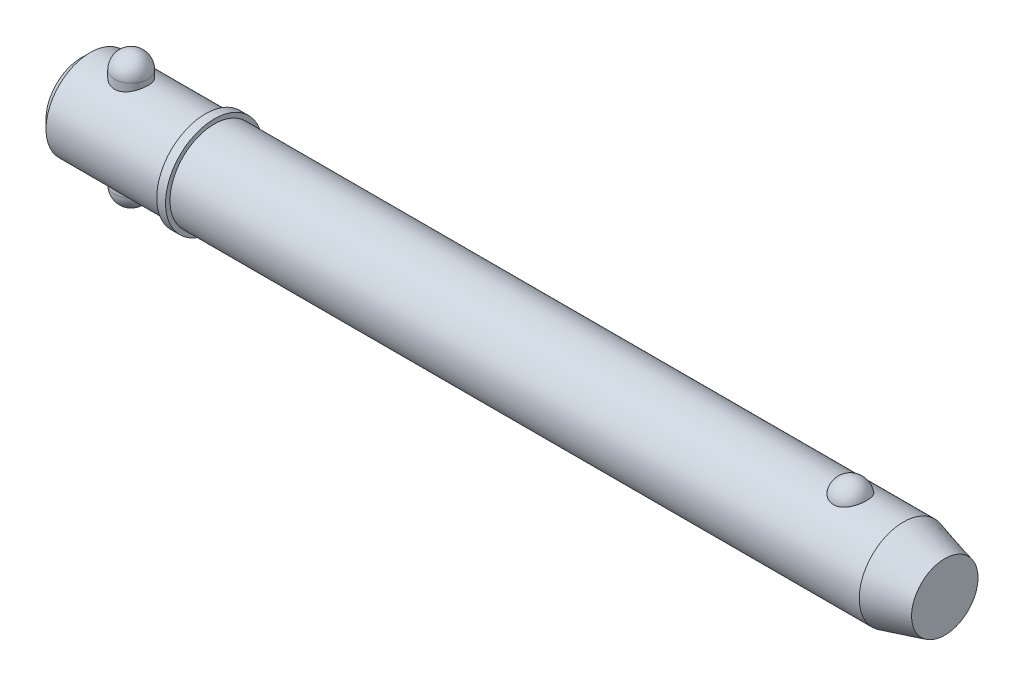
ISO-10303-21;
HEADER;
FILE_DESCRIPTION(('STEP AP214'),'2;1');
FILE_NAME('part.step','',(''),(''),'','','');
FILE_SCHEMA(('AUTOMOTIVE_DESIGN { 1 0 10303 214 1 1 1 1 }'));
ENDSEC;
DATA;
#1=APPLICATION_CONTEXT('core data for automotive mechanical design processes');
#2=APPLICATION_PROTOCOL_DEFINITION('international standard','automotive_design',2000,#1);
#3=PRODUCT_CONTEXT('',#1,'mechanical');
#4=PRODUCT('Part','Part','',(#3));
#5=PRODUCT_RELATED_PRODUCT_CATEGORY('part','',(#4));
#6=PRODUCT_DEFINITION_FORMATION('','',#4);
#7=PRODUCT_DEFINITION_CONTEXT('part definition',#1,'design');
#8=PRODUCT_DEFINITION('design','',#6,#7);
#9=PRODUCT_DEFINITION_SHAPE('','',#8);
#10=(LENGTH_UNIT() NAMED_UNIT(*) SI_UNIT(.MILLI.,.METRE.));
#11=(NAMED_UNIT(*) PLANE_ANGLE_UNIT() SI_UNIT($,.RADIAN.));
#12=(NAMED_UNIT(*) SI_UNIT($,.STERADIAN.) SOLID_ANGLE_UNIT());
#13=UNCERTAINTY_MEASURE_WITH_UNIT(LENGTH_MEASURE(1.E-05),#10,'distance_accuracy_value','');
#14=(GEOMETRIC_REPRESENTATION_CONTEXT(3) GLOBAL_UNCERTAINTY_ASSIGNED_CONTEXT((#13)) GLOBAL_UNIT_ASSIGNED_CONTEXT((#10,
#11,#12)) REPRESENTATION_CONTEXT('',''));
#15=CARTESIAN_POINT('',(0.,0.,0.));
#16=DIRECTION('',(0.,0.,1.));
#17=DIRECTION('',(1.,0.,0.));
#18=AXIS2_PLACEMENT_3D('',#15,#16,#17);
#19=CARTESIAN_POINT('',(14.28,19.05,0.));
#20=DIRECTION('',(0.,-1.,0.));
#21=DIRECTION('',(0.,0.,-1.));
#22=AXIS2_PLACEMENT_3D('',#19,#20,#21);
#23=CYLINDRICAL_SURFACE('',#22,4.76);
#24=CARTESIAN_POINT('',(14.28,-14.29,0.));
#25=DIRECTION('',(0.,-1.,0.));
#26=DIRECTION('',(0.,0.,-1.));
#27=AXIS2_PLACEMENT_3D('',#24,#25,#26);
#28=CIRCLE('',#27,4.76);
#29=CARTESIAN_POINT('',(14.28,-14.29,-4.76));
#30=VERTEX_POINT('',#29);
#31=EDGE_CURVE('P0_E10',#30,#30,#28,.F.);
#32=CARTESIAN_POINT('',(14.28,14.29,0.));
#33=DIRECTION('',(0.,-1.,0.));
#34=DIRECTION('',(0.,0.,-1.));
#35=AXIS2_PLACEMENT_3D('',#32,#33,#34);
#36=CIRCLE('',#35,4.76);
#37=CARTESIAN_POINT('',(14.28,14.29,-4.76));
#38=VERTEX_POINT('',#37);
#39=EDGE_CURVE('P0_E21',#38,#38,#36,.T.);
#40=CARTESIAN_POINT('',(14.28,-14.29,-4.76));
#41=CARTESIAN_POINT('',(14.28,-13.9922916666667,-4.76));
#42=CARTESIAN_POINT('',(14.28,-13.6945833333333,-4.76));
#43=CARTESIAN_POINT('',(14.28,-13.0991666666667,-4.76));
#44=CARTESIAN_POINT('',(14.28,-12.8014583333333,-4.76));
#45=CARTESIAN_POINT('',(14.28,-12.2060416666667,-4.76));
#46=CARTESIAN_POINT('',(14.28,-11.9083333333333,-4.76));
#47=CARTESIAN_POINT('',(14.28,-11.3129166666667,-4.76));
#48=CARTESIAN_POINT('',(14.28,-11.0152083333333,-4.76));
#49=CARTESIAN_POINT('',(14.28,-10.4197916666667,-4.76));
#50=CARTESIAN_POINT('',(14.28,-10.1220833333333,-4.76));
#51=CARTESIAN_POINT('',(14.28,-9.52666666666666,-4.76));
#52=CARTESIAN_POINT('',(14.28,-9.22895833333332,-4.76));
#53=CARTESIAN_POINT('',(14.28,-8.63354166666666,-4.76));
#54=CARTESIAN_POINT('',(14.28,-8.33583333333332,-4.76));
#55=CARTESIAN_POINT('',(14.28,-7.74041666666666,-4.76));
#56=CARTESIAN_POINT('',(14.28,-7.44270833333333,-4.76));
#57=CARTESIAN_POINT('',(14.28,-6.84729166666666,-4.76));
#58=CARTESIAN_POINT('',(14.28,-6.54958333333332,-4.76));
#59=CARTESIAN_POINT('',(14.28,-5.95416666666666,-4.76));
#60=CARTESIAN_POINT('',(14.28,-5.65645833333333,-4.76));
#61=CARTESIAN_POINT('',(14.28,-5.06104166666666,-4.76));
#62=CARTESIAN_POINT('',(14.28,-4.76333333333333,-4.76));
#63=CARTESIAN_POINT('',(14.28,-4.16791666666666,-4.76));
#64=CARTESIAN_POINT('',(14.28,-3.87020833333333,-4.76));
#65=CARTESIAN_POINT('',(14.28,-3.27479166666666,-4.76));
#66=CARTESIAN_POINT('',(14.28,-2.97708333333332,-4.76));
#67=CARTESIAN_POINT('',(14.28,-2.38166666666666,-4.76));
#68=CARTESIAN_POINT('',(14.28,-2.08395833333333,-4.76));
#69=CARTESIAN_POINT('',(14.28,-1.48854166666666,-4.76));
#70=CARTESIAN_POINT('',(14.28,-1.19083333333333,-4.76));
#71=CARTESIAN_POINT('',(14.28,-0.595416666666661,-4.76));
#72=CARTESIAN_POINT('',(14.28,-0.297708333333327,-4.76));
#73=CARTESIAN_POINT('',(14.28,0.297708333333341,-4.76));
#74=CARTESIAN_POINT('',(14.28,0.595416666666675,-4.76));
#75=CARTESIAN_POINT('',(14.28,1.19083333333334,-4.76));
#76=CARTESIAN_POINT('',(14.28,1.48854166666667,-4.76));
#77=CARTESIAN_POINT('',(14.28,2.08395833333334,-4.76));
#78=CARTESIAN_POINT('',(14.28,2.38166666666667,-4.76));
#79=CARTESIAN_POINT('',(14.28,2.97708333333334,-4.76));
#80=CARTESIAN_POINT('',(14.28,3.27479166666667,-4.76));
#81=CARTESIAN_POINT('',(14.28,3.87020833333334,-4.76));
#82=CARTESIAN_POINT('',(14.28,4.16791666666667,-4.76));
#83=CARTESIAN_POINT('',(14.28,4.76333333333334,-4.76));
#84=CARTESIAN_POINT('',(14.28,5.06104166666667,-4.76));
#85=CARTESIAN_POINT('',(14.28,5.65645833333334,-4.76));
#86=CARTESIAN_POINT('',(14.28,5.95416666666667,-4.76));
#87=CARTESIAN_POINT('',(14.28,6.54958333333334,-4.76));
#88=CARTESIAN_POINT('',(14.28,6.84729166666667,-4.76));
#89=CARTESIAN_POINT('',(14.28,7.44270833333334,-4.76));
#90=CARTESIAN_POINT('',(14.28,7.74041666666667,-4.76));
#91=CARTESIAN_POINT('',(14.28,8.33583333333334,-4.76));
#92=CARTESIAN_POINT('',(14.28,8.63354166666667,-4.76));
#93=CARTESIAN_POINT('',(14.28,9.22895833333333,-4.76));
#94=CARTESIAN_POINT('',(14.28,9.52666666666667,-4.76));
#95=CARTESIAN_POINT('',(14.28,10.1220833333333,-4.76));
#96=CARTESIAN_POINT('',(14.28,10.4197916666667,-4.76));
#97=CARTESIAN_POINT('',(14.28,11.0152083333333,-4.76));
#98=CARTESIAN_POINT('',(14.28,11.3129166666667,-4.76));
#99=CARTESIAN_POINT('',(14.28,11.9083333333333,-4.76));
#100=CARTESIAN_POINT('',(14.28,12.2060416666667,-4.76));
#101=CARTESIAN_POINT('',(14.28,12.8014583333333,-4.76));
#102=CARTESIAN_POINT('',(14.28,13.0991666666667,-4.76));
#103=CARTESIAN_POINT('',(14.28,13.6945833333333,-4.76));
#104=CARTESIAN_POINT('',(14.28,13.9922916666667,-4.76));
#105=CARTESIAN_POINT('',(14.28,14.29,-4.76));
#106=B_SPLINE_CURVE_WITH_KNOTS('',3,(#40,#41,#42,#43,#44,#45,#46,#47,#48,#49,#50,#51,#52,#53,
#54,#55,#56,#57,#58,#59,#60,#61,#62,#63,#64,#65,#66,#67,#68,#69,#70,#71,#72,#73,#74,#75,#76,#77,
#78,#79,#80,#81,#82,#83,#84,#85,#86,#87,#88,#89,#90,#91,#92,#93,#94,#95,#96,#97,#98,#99,#100,
#101,#102,#103,#104,#105),.UNSPECIFIED.,.F.,.F.,(4,2,2,2,2,2,2,2,2,2,2,2,2,2,2,2,2,2,2,2,2,2,2,
2,2,2,2,2,2,2,2,2,4),(0.,0.893125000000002,1.78625,2.67937499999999,3.5725,4.465625,5.35875,
6.25187499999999,7.145,8.038125,8.93125,9.82437499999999,10.7175,11.610625,12.50375,13.396875,
14.29,15.183125,16.07625,16.969375,17.8625,18.755625,19.64875,20.541875,21.435,22.328125,
23.22125,24.114375,25.0075,25.900625,26.79375,27.686875,28.58),.UNSPECIFIED.);
#107=EDGE_CURVE('P0_BSEAM14',#30,#38,#106,.T.);
#108=ORIENTED_EDGE('',*,*,#31,.T.);
#109=ORIENTED_EDGE('',*,*,#39,.T.);
#110=ORIENTED_EDGE('',*,*,#107,.T.);
#111=ORIENTED_EDGE('',*,*,#107,.F.);
#112=EDGE_LOOP('',(#108,#110,#109,#111));
#113=FACE_BOUND('',#112,.T.);
#114=ADVANCED_FACE('P0_F14',(#113),#23,.T.);
#115=CARTESIAN_POINT('',(14.28,-14.29,0.));
#116=DIRECTION('',(0.,0.,1.));
#117=DIRECTION('',(1.,0.,0.));
#118=AXIS2_PLACEMENT_3D('',#115,#116,#117);
#119=SPHERICAL_SURFACE('',#118,4.76);
#120=CARTESIAN_POINT('',(14.28,-14.29,0.));
#121=DIRECTION('',(0.,-1.,0.));
#122=DIRECTION('',(0.,0.,-1.));
#123=AXIS2_PLACEMENT_3D('',#120,#121,#122);
#124=SPHERICAL_SURFACE('',#123,4.76);
#125=ORIENTED_EDGE('',*,*,#31,.F.);
#126=EDGE_LOOP('',(#125));
#127=FACE_BOUND('',#126,.T.);
#128=ADVANCED_FACE('P0_F29',(#127),#124,.T.);
#129=CARTESIAN_POINT('',(14.28,14.29,0.));
#130=DIRECTION('',(0.,0.,1.));
#131=DIRECTION('',(1.,0.,0.));
#132=AXIS2_PLACEMENT_3D('',#129,#130,#131);
#133=SPHERICAL_SURFACE('',#132,4.76);
#134=CARTESIAN_POINT('',(14.28,14.29,0.));
#135=DIRECTION('',(0.,-1.,0.));
#136=DIRECTION('',(0.,0.,-1.));
#137=AXIS2_PLACEMENT_3D('',#134,#135,#136);
#138=SPHERICAL_SURFACE('',#137,4.76);
#139=ORIENTED_EDGE('',*,*,#39,.F.);
#140=EDGE_LOOP('',(#139));
#141=FACE_BOUND('',#140,.T.);
#142=ADVANCED_FACE('P0_F16',(#141),#138,.T.);
#143=CLOSED_SHELL('',(#114,#128,#142));
#144=MANIFOLD_SOLID_BREP('P0_B1',#143);
#145=CARTESIAN_POINT('',(0.,0.,0.));
#146=DIRECTION('',(1.,0.,0.));
#147=DIRECTION('',(0.,0.,-1.));
#148=AXIS2_PLACEMENT_3D('',#145,#146,#147);
#149=CYLINDRICAL_SURFACE('',#148,12.7);
#150=CARTESIAN_POINT('',(235.800738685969,0.,0.));
#151=DIRECTION('',(1.,0.,0.));
#152=DIRECTION('',(0.,0.,-1.));
#153=AXIS2_PLACEMENT_3D('',#150,#151,#152);
#154=CIRCLE('',#153,12.7);
#155=CARTESIAN_POINT('',(235.800738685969,0.,-12.7));
#156=VERTEX_POINT('',#155);
#157=EDGE_CURVE('P1_E81',#156,#156,#154,.T.);
#158=ORIENTED_EDGE('',*,*,#157,.F.);
#159=EDGE_LOOP('',(#158));
#160=FACE_BOUND('',#159,.T.);
#161=CARTESIAN_POINT('',(38.1,0.,0.));
#162=DIRECTION('',(1.,0.,0.));
#163=DIRECTION('',(0.,0.,-1.));
#164=AXIS2_PLACEMENT_3D('',#161,#162,#163);
#165=CIRCLE('',#164,12.7);
#166=CARTESIAN_POINT('',(38.1,0.,-12.7));
#167=VERTEX_POINT('',#166);
#168=EDGE_CURVE('P1_E85',#167,#167,#165,.T.);
#169=ORIENTED_EDGE('',*,*,#168,.T.);
#170=EDGE_LOOP('',(#169));
#171=FACE_BOUND('',#170,.T.);
#172=CARTESIAN_POINT('',(220.560042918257,11.7500437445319,4.81938502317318));
#173=CARTESIAN_POINT('',(220.435088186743,11.7500430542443,4.81938571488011));
#174=CARTESIAN_POINT('',(220.310144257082,11.7520975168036,4.81438658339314));
#175=CARTESIAN_POINT('',(220.061142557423,11.760253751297,4.79442904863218));
#176=CARTESIAN_POINT('',(219.937085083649,11.7663568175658,4.77946746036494));
#177=CARTESIAN_POINT('',(219.690901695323,11.7824262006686,4.73971414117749));
#178=CARTESIAN_POINT('',(219.568774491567,11.7923898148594,4.71492928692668));
#179=CARTESIAN_POINT('',(219.327187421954,11.8158938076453,4.65571340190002));
#180=CARTESIAN_POINT('',(219.20772859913,11.8294355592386,4.6212786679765));
#181=CARTESIAN_POINT('',(218.972557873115,11.8596812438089,4.54309502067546));
#182=CARTESIAN_POINT('',(218.856839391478,11.8763792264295,4.49936361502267));
#183=CARTESIAN_POINT('',(218.629653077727,11.9124878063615,4.40287235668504));
#184=CARTESIAN_POINT('',(218.518186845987,11.9318994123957,4.35010914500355));
#185=CARTESIAN_POINT('',(218.191278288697,11.9934256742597,4.17881316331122));
#186=CARTESIAN_POINT('',(217.983127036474,12.038858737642,4.04720756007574));
#187=CARTESIAN_POINT('',(217.585850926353,12.1352173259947,3.748564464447));
#188=CARTESIAN_POINT('',(217.397443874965,12.1862630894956,3.58061821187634));
#189=CARTESIAN_POINT('',(217.050521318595,12.2875163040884,3.21600758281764));
#190=CARTESIAN_POINT('',(216.892011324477,12.3377235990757,3.0193379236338));
#191=CARTESIAN_POINT('',(216.60168878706,12.4344923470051,2.592916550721));
#192=CARTESIAN_POINT('',(216.471376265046,12.4807925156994,2.36208286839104));
#193=CARTESIAN_POINT('',(216.249407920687,12.5623454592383,1.88070399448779));
#194=CARTESIAN_POINT('',(216.157755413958,12.5975972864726,1.63015711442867));
#195=CARTESIAN_POINT('',(216.014046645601,12.6538414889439,1.1129886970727));
#196=CARTESIAN_POINT('',(215.962499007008,12.6746503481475,0.846205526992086));
#197=CARTESIAN_POINT('',(215.901977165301,12.699153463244,0.307085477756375));
#198=CARTESIAN_POINT('',(215.893001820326,12.7028481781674,0.034748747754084));
#199=CARTESIAN_POINT('',(215.917731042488,12.6927785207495,-0.506073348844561));
#200=CARTESIAN_POINT('',(215.951189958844,12.6791146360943,-0.774571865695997));
#201=CARTESIAN_POINT('',(216.059687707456,12.635882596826,-1.30170246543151));
#202=CARTESIAN_POINT('',(216.13472729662,12.606314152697,-1.56033436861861));
#203=CARTESIAN_POINT('',(216.32500006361,12.5342328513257,-2.0608389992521));
#204=CARTESIAN_POINT('',(216.440287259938,12.4917026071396,-2.30268867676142));
#205=CARTESIAN_POINT('',(216.708704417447,12.3981123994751,-2.76259600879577));
#206=CARTESIAN_POINT('',(216.861837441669,12.3470517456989,-2.98065173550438));
#207=CARTESIAN_POINT('',(217.203507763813,12.2416045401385,-3.38786328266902));
#208=CARTESIAN_POINT('',(217.392201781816,12.1872040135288,-3.57688418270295));
#209=CARTESIAN_POINT('',(217.800239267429,12.0814086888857,-3.91941073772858));
#210=CARTESIAN_POINT('',(218.019580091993,12.0300136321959,-4.07291945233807));
#211=CARTESIAN_POINT('',(218.478375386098,11.9373542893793,-4.33691289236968));
#212=CARTESIAN_POINT('',(218.717304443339,11.8958982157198,-4.44824125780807));
#213=CARTESIAN_POINT('',(219.21243761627,11.8268116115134,-4.62881985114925));
#214=CARTESIAN_POINT('',(219.468635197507,11.7991758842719,-4.69808589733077));
#215=CARTESIAN_POINT('',(219.977164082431,11.7622209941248,-4.78983181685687));
#216=CARTESIAN_POINT('',(220.229041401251,11.7520502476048,-4.81449025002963));
#217=CARTESIAN_POINT('',(220.733573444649,11.7485796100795,-4.82295735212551));
#218=CARTESIAN_POINT('',(220.986228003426,11.7552763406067,-4.80677420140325));
#219=CARTESIAN_POINT('',(221.476834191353,11.7842584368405,-4.73525430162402));
#220=CARTESIAN_POINT('',(221.714998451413,11.8060486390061,-4.68116061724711));
#221=CARTESIAN_POINT('',(222.178489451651,11.8622750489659,-4.53678133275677));
#222=CARTESIAN_POINT('',(222.403815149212,11.8967122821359,-4.44649279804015));
#223=CARTESIAN_POINT('',(222.840801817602,11.9754603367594,-4.22987613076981));
#224=CARTESIAN_POINT('',(223.052057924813,12.0199699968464,-4.10280539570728));
#225=CARTESIAN_POINT('',(223.450601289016,12.1138028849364,-3.81685409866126));
#226=CARTESIAN_POINT('',(223.637883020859,12.163127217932,-3.65796622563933));
#227=CARTESIAN_POINT('',(223.993350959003,12.2642343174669,-3.30364864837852));
#228=CARTESIAN_POINT('',(224.160111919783,12.3160165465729,-3.10678783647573));
#229=CARTESIAN_POINT('',(224.459579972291,12.4142566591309,-2.68748409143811));
#230=CARTESIAN_POINT('',(224.592280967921,12.4607135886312,-2.4650365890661));
#231=CARTESIAN_POINT('',(224.824691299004,12.5450236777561,-1.9928951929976));
#232=CARTESIAN_POINT('',(224.923215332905,12.5825557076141,-1.74255918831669));
#233=CARTESIAN_POINT('',(225.079227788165,12.6431720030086,-1.22773734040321));
#234=CARTESIAN_POINT('',(225.136715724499,12.6662560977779,-0.963251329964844));
#235=CARTESIAN_POINT('',(225.209544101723,12.6956486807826,-0.427355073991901));
#236=CARTESIAN_POINT('',(225.224837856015,12.7019385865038,-0.155937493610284));
#237=CARTESIAN_POINT('',(225.212779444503,12.6970201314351,0.385928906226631));
#238=CARTESIAN_POINT('',(225.18542805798,12.6858120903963,0.656377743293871));
#239=CARTESIAN_POINT('',(225.113060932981,12.6568455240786,1.05454017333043));
#240=CARTESIAN_POINT('',(225.083796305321,12.6451962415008,1.185778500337));
#241=CARTESIAN_POINT('',(225.015022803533,12.6181819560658,1.44513808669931));
#242=CARTESIAN_POINT('',(224.975517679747,12.6028183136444,1.57326046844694));
#243=CARTESIAN_POINT('',(224.886439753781,12.5687547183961,1.82554978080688));
#244=CARTESIAN_POINT('',(224.836862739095,12.5500533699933,1.94971503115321));
#245=CARTESIAN_POINT('',(224.72792115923,12.5098093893,2.19314370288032));
#246=CARTESIAN_POINT('',(224.668560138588,12.4882677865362,2.31240887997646));
#247=CARTESIAN_POINT('',(224.53997128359,12.4427679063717,2.5459303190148));
#248=CARTESIAN_POINT('',(224.470688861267,12.4187964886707,2.66015396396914));
#249=CARTESIAN_POINT('',(224.322903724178,12.3691892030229,2.882026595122));
#250=CARTESIAN_POINT('',(224.244404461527,12.3435539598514,2.98967802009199));
#251=CARTESIAN_POINT('',(224.078550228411,12.2912955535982,3.1977438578));
#252=CARTESIAN_POINT('',(223.991191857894,12.2646720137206,3.298155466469));
#253=CARTESIAN_POINT('',(223.808161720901,12.2111945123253,3.49095035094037));
#254=CARTESIAN_POINT('',(223.712493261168,12.1843406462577,3.58333679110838));
#255=CARTESIAN_POINT('',(223.513627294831,12.1312249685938,3.75922876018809));
#256=CARTESIAN_POINT('',(223.410450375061,12.104961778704,3.84275713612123));
#257=CARTESIAN_POINT('',(223.19701336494,12.0537284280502,4.00056406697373));
#258=CARTESIAN_POINT('',(223.086756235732,12.028757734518,4.07484645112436));
#259=CARTESIAN_POINT('',(222.859755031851,11.9808306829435,4.21367959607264));
#260=CARTESIAN_POINT('',(222.743006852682,11.9578756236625,4.27822410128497));
#261=CARTESIAN_POINT('',(222.50394258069,11.9147184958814,4.39698483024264));
#262=CARTESIAN_POINT('',(222.381628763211,11.894515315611,4.45120522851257));
#263=CARTESIAN_POINT('',(222.122952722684,11.8561129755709,4.55255353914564));
#264=CARTESIAN_POINT('',(221.986223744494,11.8381764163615,4.59884858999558));
#265=CARTESIAN_POINT('',(221.708608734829,11.8069093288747,4.67853897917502));
#266=CARTESIAN_POINT('',(221.567724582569,11.7935767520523,4.71194005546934));
#267=CARTESIAN_POINT('',(221.28309446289,11.7720277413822,4.76552188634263));
#268=CARTESIAN_POINT('',(221.139348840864,11.7638106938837,4.78570422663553));
#269=CARTESIAN_POINT('',(220.850411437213,11.7528195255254,4.81263433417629));
#270=CARTESIAN_POINT('',(220.705219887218,11.7500445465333,4.81938421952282));
#271=CARTESIAN_POINT('',(220.560042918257,11.7500437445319,4.81938502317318));
#272=B_SPLINE_CURVE_WITH_KNOTS('',3,(#172,#173,#174,#175,#176,#177,#178,#179,#180,#181,#182,
#183,#184,#185,#186,#187,#188,#189,#190,#191,#192,#193,#194,#195,#196,#197,#198,#199,#200,#201,
#202,#203,#204,#205,#206,#207,#208,#209,#210,#211,#212,#213,#214,#215,#216,#217,#218,#219,#220,
#221,#222,#223,#224,#225,#226,#227,#228,#229,#230,#231,#232,#233,#234,#235,#236,#237,#238,#239,
#240,#241,#242,#243,#244,#245,#246,#247,#248,#249,#250,#251,#252,#253,#254,#255,#256,#257,#258,
#259,#260,#261,#262,#263,#264,#265,#266,#267,#268,#269,#270,#271),.UNSPECIFIED.,.T.,.F.,(4,2,2,
2,2,2,2,2,2,2,2,2,2,2,2,2,2,2,2,2,2,2,2,2,2,2,2,2,2,2,2,2,2,2,2,2,2,2,2,2,2,2,2,2,2,2,2,2,2,4),
(0.,0.374729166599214,0.749578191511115,1.12416526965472,1.49889629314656,1.87292776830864,
2.24709865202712,2.99481328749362,3.76399449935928,4.53331735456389,5.3368391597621,
6.14042986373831,6.95405296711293,7.76765424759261,8.57656703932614,9.38549455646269,
10.1955119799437,11.0055949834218,11.8193353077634,12.6330054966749,13.4294141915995,
14.2255231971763,14.9815786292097,15.7374826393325,16.4696948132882,17.2019663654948,
17.9501979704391,18.6986017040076,19.4844704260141,20.2704797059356,21.0815215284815,
21.8925729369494,22.7045213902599,23.5164550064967,23.9209608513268,24.3253187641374,
24.7298461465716,25.1342272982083,25.5409255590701,25.9474719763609,26.3541750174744,
26.7607169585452,27.1661834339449,27.5714814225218,27.9770386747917,28.3824315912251,
28.8181206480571,29.2536155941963,29.6890582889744,30.1244323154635),.UNSPECIFIED.);
#273=CARTESIAN_POINT('',(220.560042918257,11.7500437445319,4.81938502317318));
#274=VERTEX_POINT('',#273);
#275=EDGE_CURVE('P1_E35',#274,#274,#272,.T.);
#276=ORIENTED_EDGE('',*,*,#275,.T.);
#277=EDGE_LOOP('',(#276));
#278=FACE_BOUND('',#277,.T.);
#279=ADVANCED_FACE('P1_F13',(#160,#171,#278),#149,.T.);
#280=CARTESIAN_POINT('',(0.,0.,0.));
#281=DIRECTION('',(-1.,0.,0.));
#282=DIRECTION('',(0.,0.,1.));
#283=AXIS2_PLACEMENT_3D('',#280,#281,#282);
#284=PLANE('',#283);
#285=CARTESIAN_POINT('',(0.,0.,0.));
#286=DIRECTION('',(1.,0.,0.));
#287=DIRECTION('',(0.,0.,-1.));
#288=AXIS2_PLACEMENT_3D('',#285,#286,#287);
#289=CIRCLE('',#288,10.16);
#290=CARTESIAN_POINT('',(0.,0.,-10.16));
#291=VERTEX_POINT('',#290);
#292=EDGE_CURVE('P1_E9',#291,#291,#289,.T.);
#293=ORIENTED_EDGE('',*,*,#292,.F.);
#294=EDGE_LOOP('',(#293));
#295=FACE_BOUND('',#294,.T.);
#296=ADVANCED_FACE('P1_F15',(#295),#284,.T.);
#297=CARTESIAN_POINT('',(2.53999999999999,0.,0.));
#298=DIRECTION('',(1.,0.,0.));
#299=DIRECTION('',(0.,0.,-1.));
#300=AXIS2_PLACEMENT_3D('',#297,#298,#299);
#301=CONICAL_SURFACE('',#300,12.7,0.78539816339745);
#302=ORIENTED_EDGE('',*,*,#292,.T.);
#303=EDGE_LOOP('',(#302));
#304=FACE_BOUND('',#303,.T.);
#305=CARTESIAN_POINT('',(2.53999999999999,0.,0.));
#306=DIRECTION('',(1.,0.,0.));
#307=DIRECTION('',(0.,0.,-1.));
#308=AXIS2_PLACEMENT_3D('',#305,#306,#307);
#309=CIRCLE('',#308,12.7);
#310=CARTESIAN_POINT('',(2.53999999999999,0.,-12.7));
#311=VERTEX_POINT('',#310);
#312=EDGE_CURVE('P1_E26',#311,#311,#309,.T.);
#313=ORIENTED_EDGE('',*,*,#312,.F.);
#314=EDGE_LOOP('',(#313));
#315=FACE_BOUND('',#314,.T.);
#316=ADVANCED_FACE('P1_F77',(#304,#315),#301,.T.);
#317=CARTESIAN_POINT('',(0.,0.,0.));
#318=DIRECTION('',(1.,0.,0.));
#319=DIRECTION('',(0.,0.,-1.));
#320=AXIS2_PLACEMENT_3D('',#317,#318,#319);
#321=CYLINDRICAL_SURFACE('',#320,12.7);
#322=CARTESIAN_POINT('',(14.28,-11.7742260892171,4.76));
#323=CARTESIAN_POINT('',(14.1514948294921,-11.7742255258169,4.76000061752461));
#324=CARTESIAN_POINT('',(14.0229980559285,-11.7763355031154,4.75479194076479));
#325=CARTESIAN_POINT('',(13.7669369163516,-11.7847043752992,4.73401198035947));
#326=CARTESIAN_POINT('',(13.6393728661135,-11.7909646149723,4.71843733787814));
#327=CARTESIAN_POINT('',(13.386226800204,-11.8074248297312,4.67709434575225));
#328=CARTESIAN_POINT('',(13.2606439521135,-11.8176231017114,4.65133040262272));
#329=CARTESIAN_POINT('',(13.0122434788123,-11.8416347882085,4.58985545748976));
#330=CARTESIAN_POINT('',(12.8894269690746,-11.8554496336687,4.55414051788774));
#331=CARTESIAN_POINT('',(12.6477622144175,-11.8862222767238,4.47320764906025));
#332=CARTESIAN_POINT('',(12.5289037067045,-11.9031710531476,4.4280169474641));
#333=CARTESIAN_POINT('',(12.2955059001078,-11.939736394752,4.32845291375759));
#334=CARTESIAN_POINT('',(12.1809682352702,-11.9593539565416,4.2740761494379));
#335=CARTESIAN_POINT('',(11.8448901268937,-12.0213893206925,4.09777237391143));
#336=CARTESIAN_POINT('',(11.6307077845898,-12.0670135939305,3.9626122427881));
#337=CARTESIAN_POINT('',(11.2179129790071,-12.1641514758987,3.65386230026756));
#338=CARTESIAN_POINT('',(11.0204399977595,-12.2158379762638,3.47881300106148));
#339=CARTESIAN_POINT('',(10.6568212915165,-12.3178468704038,3.09829182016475));
#340=CARTESIAN_POINT('',(10.4906822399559,-12.3681689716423,2.89281347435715));
#341=CARTESIAN_POINT('',(10.1890299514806,-12.4638367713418,2.44867909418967));
#342=CARTESIAN_POINT('',(10.054749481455,-12.5089552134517,2.20913281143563));
#343=CARTESIAN_POINT('',(9.82886079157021,-12.5870472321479,1.70885919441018));
#344=CARTESIAN_POINT('',(9.73723778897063,-12.620025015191,1.44813923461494));
#345=CARTESIAN_POINT('',(9.60324488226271,-12.6688874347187,0.9248423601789));
#346=CARTESIAN_POINT('',(9.55892269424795,-12.6854474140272,0.662829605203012));
#347=CARTESIAN_POINT('',(9.5145335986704,-12.7020320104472,0.134596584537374));
#348=CARTESIAN_POINT('',(9.5144523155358,-12.7020619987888,-0.131622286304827));
#349=CARTESIAN_POINT('',(9.55741019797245,-12.6860129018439,-0.646717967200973));
#350=CARTESIAN_POINT('',(9.59831845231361,-12.6707298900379,-0.895801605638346));
#351=CARTESIAN_POINT('',(9.71850987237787,-12.6268158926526,-1.38327219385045));
#352=CARTESIAN_POINT('',(9.79779575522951,-12.5981839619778,-1.62165838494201));
#353=CARTESIAN_POINT('',(9.99348296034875,-12.5298894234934,-2.08508424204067));
#354=CARTESIAN_POINT('',(10.110407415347,-12.4900724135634,-2.30987931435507));
#355=CARTESIAN_POINT('',(10.3775896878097,-12.4034373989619,-2.7372158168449));
#356=CARTESIAN_POINT('',(10.5278582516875,-12.3566171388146,-2.93975004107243));
#357=CARTESIAN_POINT('',(10.8677318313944,-12.257571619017,-3.32936830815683));
#358=CARTESIAN_POINT('',(11.0591227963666,-12.2051903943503,-3.51485714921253));
#359=CARTESIAN_POINT('',(11.4706087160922,-12.1031155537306,-3.85170663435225));
#360=CARTESIAN_POINT('',(11.6907108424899,-12.0534226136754,-4.00305872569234));
#361=CARTESIAN_POINT('',(12.1596597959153,-11.9613684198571,-4.27038218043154));
#362=CARTESIAN_POINT('',(12.4090353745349,-11.9191939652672,-4.38549550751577));
#363=CARTESIAN_POINT('',(12.9256290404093,-11.8491124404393,-4.57149117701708));
#364=CARTESIAN_POINT('',(13.1928371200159,-11.8211974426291,-4.64239810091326));
#365=CARTESIAN_POINT('',(13.7217488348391,-11.7846654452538,-4.73434137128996));
#366=CARTESIAN_POINT('',(13.9829438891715,-11.7750694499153,-4.75791141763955));
#367=CARTESIAN_POINT('',(14.5056760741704,-11.7734909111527,-4.76182097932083));
#368=CARTESIAN_POINT('',(14.7672131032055,-11.7815039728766,-4.74217128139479));
#369=CARTESIAN_POINT('',(15.2702140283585,-11.8132466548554,-4.66249544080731));
#370=CARTESIAN_POINT('',(15.5120417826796,-11.8362133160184,-4.60442726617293));
#371=CARTESIAN_POINT('',(15.9824097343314,-11.8943704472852,-4.45202868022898));
#372=CARTESIAN_POINT('',(16.2109472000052,-11.9295634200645,-4.35769084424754));
#373=CARTESIAN_POINT('',(16.6577741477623,-12.0098310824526,-4.13144368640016));
#374=CARTESIAN_POINT('',(16.8753590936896,-12.055226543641,-3.99825937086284));
#375=CARTESIAN_POINT('',(17.2859732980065,-12.150238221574,-3.69949845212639));
#376=CARTESIAN_POINT('',(17.4789935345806,-12.19985597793,-3.5339100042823));
#377=CARTESIAN_POINT('',(17.8477707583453,-12.3015434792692,-3.1624728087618));
#378=CARTESIAN_POINT('',(18.0216609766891,-12.3535695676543,-2.95473880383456));
#379=CARTESIAN_POINT('',(18.254545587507,-12.426745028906,-2.62277433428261));
#380=CARTESIAN_POINT('',(18.3275489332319,-12.4503382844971,-2.50865480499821));
#381=CARTESIAN_POINT('',(18.463723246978,-12.4952713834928,-2.27428971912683));
#382=CARTESIAN_POINT('',(18.5268984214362,-12.5166121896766,-2.15404681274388));
#383=CARTESIAN_POINT('',(18.6427140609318,-12.5563817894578,-1.90858448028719));
#384=CARTESIAN_POINT('',(18.6953855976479,-12.5748191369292,-1.78338108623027));
#385=CARTESIAN_POINT('',(18.7899337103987,-12.6083284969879,-1.52857834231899));
#386=CARTESIAN_POINT('',(18.8318147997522,-12.6234019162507,-1.39898085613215));
#387=CARTESIAN_POINT('',(18.9043819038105,-12.6497495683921,-1.13633254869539));
#388=CARTESIAN_POINT('',(18.9350698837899,-12.6610244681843,-1.00328233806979));
#389=CARTESIAN_POINT('',(18.9849303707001,-12.6794412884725,-0.734761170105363));
#390=CARTESIAN_POINT('',(19.0041035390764,-12.6865834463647,-0.59929035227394));
#391=CARTESIAN_POINT('',(19.0299427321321,-12.6962286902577,-0.335006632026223));
#392=CARTESIAN_POINT('',(19.0372742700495,-12.698978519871,-0.206267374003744));
#393=CARTESIAN_POINT('',(19.0414668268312,-12.7005496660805,0.0514515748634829));
#394=CARTESIAN_POINT('',(19.038324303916,-12.69936965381,0.180431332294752));
#395=CARTESIAN_POINT('',(19.0215965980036,-12.6931114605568,0.437551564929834));
#396=CARTESIAN_POINT('',(19.0080165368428,-12.6880351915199,0.565692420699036));
#397=CARTESIAN_POINT('',(18.9705519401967,-12.6741222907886,0.820297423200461));
#398=CARTESIAN_POINT('',(18.9466635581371,-12.665284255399,0.946760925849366));
#399=CARTESIAN_POINT('',(18.8895279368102,-12.6443449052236,1.19395899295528));
#400=CARTESIAN_POINT('',(18.8565273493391,-12.6323299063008,1.3147578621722));
#401=CARTESIAN_POINT('',(18.781239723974,-12.6052503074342,1.55308888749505));
#402=CARTESIAN_POINT('',(18.738949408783,-12.5901846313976,1.67061987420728));
#403=CARTESIAN_POINT('',(18.5986461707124,-12.5409473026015,2.01714406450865));
#404=CARTESIAN_POINT('',(18.4871532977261,-12.502717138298,2.24027279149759));
#405=CARTESIAN_POINT('',(18.2262440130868,-12.4173042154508,2.6742599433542));
#406=CARTESIAN_POINT('',(18.0754310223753,-12.3698127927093,2.88420891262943));
#407=CARTESIAN_POINT('',(17.7421836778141,-12.271667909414,3.27675114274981));
#408=CARTESIAN_POINT('',(17.5597380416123,-12.2210133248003,3.45933459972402));
#409=CARTESIAN_POINT('',(17.2605468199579,-12.1452079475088,3.7138066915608));
#410=CARTESIAN_POINT('',(17.1535518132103,-12.119328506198,3.79719993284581));
#411=CARTESIAN_POINT('',(16.9326449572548,-12.0688597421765,3.95467398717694));
#412=CARTESIAN_POINT('',(16.8187356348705,-12.0442699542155,4.02875817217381));
#413=CARTESIAN_POINT('',(16.5846234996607,-11.9971053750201,4.16711104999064));
#414=CARTESIAN_POINT('',(16.4644172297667,-11.9745317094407,4.23137427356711));
#415=CARTESIAN_POINT('',(16.2185866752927,-11.9321360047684,4.34949041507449));
#416=CARTESIAN_POINT('',(16.09296473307,-11.9123127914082,4.40334777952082));
#417=CARTESIAN_POINT('',(15.8314769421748,-11.875268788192,4.50232278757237));
#418=CARTESIAN_POINT('',(15.6954035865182,-11.8582009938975,4.54695127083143));
#419=CARTESIAN_POINT('',(15.4194002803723,-11.8284328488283,4.62383807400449));
#420=CARTESIAN_POINT('',(15.2794720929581,-11.815730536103,4.6561019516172));
#421=CARTESIAN_POINT('',(14.9969657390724,-11.7951940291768,4.70788444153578));
#422=CARTESIAN_POINT('',(14.8543884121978,-11.7873583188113,4.72740702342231));
#423=CARTESIAN_POINT('',(14.5678704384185,-11.7768749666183,4.75346370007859));
#424=CARTESIAN_POINT('',(14.4239299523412,-11.7742267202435,4.75999930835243));
#425=CARTESIAN_POINT('',(14.28,-11.7742260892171,4.76));
#426=B_SPLINE_CURVE_WITH_KNOTS('',3,(#322,#323,#324,#325,#326,#327,#328,#329,#330,#331,#332,
#333,#334,#335,#336,#337,#338,#339,#340,#341,#342,#343,#344,#345,#346,#347,#348,#349,#350,#351,
#352,#353,#354,#355,#356,#357,#358,#359,#360,#361,#362,#363,#364,#365,#366,#367,#368,#369,#370,
#371,#372,#373,#374,#375,#376,#377,#378,#379,#380,#381,#382,#383,#384,#385,#386,#387,#388,#389,
#390,#391,#392,#393,#394,#395,#396,#397,#398,#399,#400,#401,#402,#403,#404,#405,#406,#407,#408,
#409,#410,#411,#412,#413,#414,#415,#416,#417,#418,#419,#420,#421,#422,#423,#424,#425),
.UNSPECIFIED.,.T.,.F.,(4,2,2,2,2,2,2,2,2,2,2,2,2,2,2,2,2,2,2,2,2,2,2,2,2,2,2,2,2,2,2,2,2,2,2,2,
2,2,2,2,2,2,2,2,2,2,2,2,2,2,2,4),(0.,0.385378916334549,0.770882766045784,1.15622008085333,
1.54171009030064,1.92610725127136,2.31064835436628,3.07917291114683,3.88239385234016,
4.68578566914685,5.51648193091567,6.34689010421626,7.14151420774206,7.93588010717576,
8.69098665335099,9.44614666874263,10.2122918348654,10.9786842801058,11.789876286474,
12.6012713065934,13.4306405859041,14.2595482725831,15.0427613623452,15.8257790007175,
16.5716820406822,17.3177378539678,18.0917395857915,18.8660247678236,19.6893332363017,
20.1014571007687,20.5134040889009,20.9241137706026,21.3346513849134,21.7451168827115,
22.1555587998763,22.542011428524,22.928594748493,23.3149884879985,23.7015265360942,
24.0784835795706,24.4555738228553,25.2091300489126,25.994347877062,26.7798463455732,
27.1937428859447,27.6074890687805,28.0214648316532,28.4352633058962,28.8672794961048,
29.299101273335,29.7307884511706,30.1624253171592),.UNSPECIFIED.);
#427=CARTESIAN_POINT('',(14.28,-11.7742260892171,4.76));
#428=VERTEX_POINT('',#427);
#429=EDGE_CURVE('P1_E17',#428,#428,#426,.T.);
#430=ORIENTED_EDGE('',*,*,#429,.F.);
#431=EDGE_LOOP('',(#430));
#432=FACE_BOUND('',#431,.T.);
#433=CARTESIAN_POINT('',(14.28,11.7742260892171,4.76));
#434=CARTESIAN_POINT('',(14.4085051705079,11.7742255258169,4.76000061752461));
#435=CARTESIAN_POINT('',(14.5370019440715,11.7763355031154,4.75479194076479));
#436=CARTESIAN_POINT('',(14.7930630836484,11.7847043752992,4.73401198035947));
#437=CARTESIAN_POINT('',(14.9206271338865,11.7909646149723,4.71843733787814));
#438=CARTESIAN_POINT('',(15.173773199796,11.8074248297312,4.67709434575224));
#439=CARTESIAN_POINT('',(15.2993560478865,11.8176231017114,4.65133040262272));
#440=CARTESIAN_POINT('',(15.5477565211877,11.8416347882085,4.58985545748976));
#441=CARTESIAN_POINT('',(15.6705730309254,11.8554496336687,4.55414051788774));
#442=CARTESIAN_POINT('',(15.9122377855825,11.8862222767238,4.47320764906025));
#443=CARTESIAN_POINT('',(16.0310962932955,11.9031710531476,4.4280169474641));
#444=CARTESIAN_POINT('',(16.2644940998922,11.939736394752,4.32845291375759));
#445=CARTESIAN_POINT('',(16.3790317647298,11.9593539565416,4.2740761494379));
#446=CARTESIAN_POINT('',(16.7151098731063,12.0213893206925,4.09777237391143));
#447=CARTESIAN_POINT('',(16.9292922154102,12.0670135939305,3.96261224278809));
#448=CARTESIAN_POINT('',(17.3420870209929,12.1641514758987,3.65386230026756));
#449=CARTESIAN_POINT('',(17.5395600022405,12.2158379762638,3.47881300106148));
#450=CARTESIAN_POINT('',(17.9031787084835,12.3178468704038,3.09829182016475));
#451=CARTESIAN_POINT('',(18.0693177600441,12.3681689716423,2.89281347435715));
#452=CARTESIAN_POINT('',(18.3709700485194,12.4638367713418,2.44867909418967));
#453=CARTESIAN_POINT('',(18.505250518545,12.5089552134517,2.20913281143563));
#454=CARTESIAN_POINT('',(18.7311392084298,12.5870472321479,1.70885919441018));
#455=CARTESIAN_POINT('',(18.8227622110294,12.620025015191,1.44813923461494));
#456=CARTESIAN_POINT('',(18.9567551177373,12.6688874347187,0.924842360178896));
#457=CARTESIAN_POINT('',(19.0010773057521,12.6854474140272,0.662829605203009));
#458=CARTESIAN_POINT('',(19.0454664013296,12.7020320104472,0.134596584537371));
#459=CARTESIAN_POINT('',(19.0455476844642,12.7020619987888,-0.13162228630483));
#460=CARTESIAN_POINT('',(19.0025898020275,12.6860129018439,-0.646717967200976));
#461=CARTESIAN_POINT('',(18.9616815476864,12.6707298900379,-0.89580160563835));
#462=CARTESIAN_POINT('',(18.8414901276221,12.6268158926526,-1.38327219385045));
#463=CARTESIAN_POINT('',(18.7622042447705,12.5981839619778,-1.62165838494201));
#464=CARTESIAN_POINT('',(18.5665170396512,12.5298894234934,-2.08508424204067));
#465=CARTESIAN_POINT('',(18.449592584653,12.4900724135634,-2.30987931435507));
#466=CARTESIAN_POINT('',(18.1824103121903,12.4034373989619,-2.7372158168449));
#467=CARTESIAN_POINT('',(18.0321417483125,12.3566171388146,-2.93975004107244));
#468=CARTESIAN_POINT('',(17.6922681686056,12.257571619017,-3.32936830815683));
#469=CARTESIAN_POINT('',(17.5008772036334,12.2051903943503,-3.51485714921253));
#470=CARTESIAN_POINT('',(17.0893912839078,12.1031155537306,-3.85170663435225));
#471=CARTESIAN_POINT('',(16.8692891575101,12.0534226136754,-4.00305872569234));
#472=CARTESIAN_POINT('',(16.4003402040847,11.9613684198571,-4.27038218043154));
#473=CARTESIAN_POINT('',(16.1509646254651,11.9191939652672,-4.38549550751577));
#474=CARTESIAN_POINT('',(15.6343709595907,11.8491124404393,-4.57149117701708));
#475=CARTESIAN_POINT('',(15.367162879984,11.8211974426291,-4.64239810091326));
#476=CARTESIAN_POINT('',(14.8382511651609,11.7846654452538,-4.73434137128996));
#477=CARTESIAN_POINT('',(14.5770561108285,11.7750694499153,-4.75791141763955));
#478=CARTESIAN_POINT('',(14.0543239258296,11.7734909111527,-4.76182097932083));
#479=CARTESIAN_POINT('',(13.7927868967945,11.7815039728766,-4.74217128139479));
#480=CARTESIAN_POINT('',(13.2897859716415,11.8132466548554,-4.66249544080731));
#481=CARTESIAN_POINT('',(13.0479582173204,11.8362133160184,-4.60442726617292));
#482=CARTESIAN_POINT('',(12.5775902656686,11.8943704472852,-4.45202868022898));
#483=CARTESIAN_POINT('',(12.3490527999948,11.9295634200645,-4.35769084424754));
#484=CARTESIAN_POINT('',(11.9022258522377,12.0098310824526,-4.13144368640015));
#485=CARTESIAN_POINT('',(11.6846409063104,12.055226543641,-3.99825937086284));
#486=CARTESIAN_POINT('',(11.2740267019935,12.150238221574,-3.69949845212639));
#487=CARTESIAN_POINT('',(11.0810064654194,12.19985597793,-3.5339100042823));
#488=CARTESIAN_POINT('',(10.7122292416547,12.3015434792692,-3.1624728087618));
#489=CARTESIAN_POINT('',(10.5383390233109,12.3535695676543,-2.95473880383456));
#490=CARTESIAN_POINT('',(10.305454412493,12.426745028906,-2.6227743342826));
#491=CARTESIAN_POINT('',(10.2324510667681,12.4503382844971,-2.50865480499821));
#492=CARTESIAN_POINT('',(10.096276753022,12.4952713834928,-2.27428971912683));
#493=CARTESIAN_POINT('',(10.0331015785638,12.5166121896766,-2.15404681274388));
#494=CARTESIAN_POINT('',(9.91728593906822,12.5563817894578,-1.90858448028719));
#495=CARTESIAN_POINT('',(9.8646144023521,12.5748191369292,-1.78338108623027));
#496=CARTESIAN_POINT('',(9.77006628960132,12.6083284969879,-1.52857834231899));
#497=CARTESIAN_POINT('',(9.72818520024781,12.6234019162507,-1.39898085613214));
#498=CARTESIAN_POINT('',(9.65561809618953,12.6497495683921,-1.13633254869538));
#499=CARTESIAN_POINT('',(9.62493011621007,12.6610244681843,-1.00328233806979));
#500=CARTESIAN_POINT('',(9.57506962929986,12.6794412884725,-0.734761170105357));
#501=CARTESIAN_POINT('',(9.55589646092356,12.6865834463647,-0.599290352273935));
#502=CARTESIAN_POINT('',(9.53005726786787,12.6962286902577,-0.335006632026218));
#503=CARTESIAN_POINT('',(9.52272572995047,12.698978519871,-0.20626737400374));
#504=CARTESIAN_POINT('',(9.51853317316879,12.7005496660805,0.0514515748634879));
#505=CARTESIAN_POINT('',(9.52167569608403,12.69936965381,0.180431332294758));
#506=CARTESIAN_POINT('',(9.53840340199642,12.6931114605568,0.43755156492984));
#507=CARTESIAN_POINT('',(9.55198346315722,12.6880351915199,0.565692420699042));
#508=CARTESIAN_POINT('',(9.58944805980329,12.6741222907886,0.820297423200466));
#509=CARTESIAN_POINT('',(9.61333644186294,12.665284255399,0.946760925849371));
#510=CARTESIAN_POINT('',(9.67047206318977,12.6443449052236,1.19395899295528));
#511=CARTESIAN_POINT('',(9.7034726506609,12.6323299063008,1.31475786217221));
#512=CARTESIAN_POINT('',(9.77876027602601,12.6052503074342,1.55308888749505));
#513=CARTESIAN_POINT('',(9.82105059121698,12.5901846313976,1.67061987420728));
#514=CARTESIAN_POINT('',(9.96135382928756,12.5409473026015,2.01714406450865));
#515=CARTESIAN_POINT('',(10.0728467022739,12.502717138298,2.24027279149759));
#516=CARTESIAN_POINT('',(10.3337559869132,12.4173042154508,2.6742599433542));
#517=CARTESIAN_POINT('',(10.4845689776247,12.3698127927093,2.88420891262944));
#518=CARTESIAN_POINT('',(10.8178163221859,12.271667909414,3.27675114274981));
#519=CARTESIAN_POINT('',(11.0002619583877,12.2210133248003,3.45933459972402));
#520=CARTESIAN_POINT('',(11.2994531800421,12.1452079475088,3.7138066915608));
#521=CARTESIAN_POINT('',(11.4064481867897,12.119328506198,3.79719993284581));
#522=CARTESIAN_POINT('',(11.6273550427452,12.0688597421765,3.95467398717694));
#523=CARTESIAN_POINT('',(11.7412643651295,12.0442699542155,4.02875817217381));
#524=CARTESIAN_POINT('',(11.9753765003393,11.9971053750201,4.16711104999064));
#525=CARTESIAN_POINT('',(12.0955827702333,11.9745317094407,4.23137427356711));
#526=CARTESIAN_POINT('',(12.3414133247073,11.9321360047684,4.34949041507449));
#527=CARTESIAN_POINT('',(12.46703526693,11.9123127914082,4.40334777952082));
#528=CARTESIAN_POINT('',(12.7285230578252,11.875268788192,4.50232278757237));
#529=CARTESIAN_POINT('',(12.8645964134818,11.8582009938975,4.54695127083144));
#530=CARTESIAN_POINT('',(13.1405997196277,11.8284328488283,4.62383807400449));
#531=CARTESIAN_POINT('',(13.2805279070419,11.815730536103,4.6561019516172));
#532=CARTESIAN_POINT('',(13.5630342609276,11.7951940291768,4.70788444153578));
#533=CARTESIAN_POINT('',(13.7056115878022,11.7873583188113,4.72740702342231));
#534=CARTESIAN_POINT('',(13.9921295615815,11.7768749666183,4.75346370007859));
#535=CARTESIAN_POINT('',(14.1360700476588,11.7742267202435,4.75999930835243));
#536=CARTESIAN_POINT('',(14.28,11.7742260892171,4.76));
#537=B_SPLINE_CURVE_WITH_KNOTS('',3,(#433,#434,#435,#436,#437,#438,#439,#440,#441,#442,#443,
#444,#445,#446,#447,#448,#449,#450,#451,#452,#453,#454,#455,#456,#457,#458,#459,#460,#461,#462,
#463,#464,#465,#466,#467,#468,#469,#470,#471,#472,#473,#474,#475,#476,#477,#478,#479,#480,#481,
#482,#483,#484,#485,#486,#487,#488,#489,#490,#491,#492,#493,#494,#495,#496,#497,#498,#499,#500,
#501,#502,#503,#504,#505,#506,#507,#508,#509,#510,#511,#512,#513,#514,#515,#516,#517,#518,#519,
#520,#521,#522,#523,#524,#525,#526,#527,#528,#529,#530,#531,#532,#533,#534,#535,#536),
.UNSPECIFIED.,.T.,.F.,(4,2,2,2,2,2,2,2,2,2,2,2,2,2,2,2,2,2,2,2,2,2,2,2,2,2,2,2,2,2,2,2,2,2,2,2,
2,2,2,2,2,2,2,2,2,2,2,2,2,2,2,4),(0.,0.385378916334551,0.770882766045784,1.15622008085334,
1.54171009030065,1.92610725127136,2.31064835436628,3.07917291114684,3.88239385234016,
4.68578566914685,5.51648193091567,6.34689010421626,7.14151420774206,7.93588010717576,
8.690986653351,9.44614666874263,10.2122918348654,10.9786842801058,11.789876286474,
12.6012713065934,13.4306405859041,14.2595482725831,15.0427613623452,15.8257790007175,
16.5716820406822,17.3177378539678,18.0917395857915,18.8660247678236,19.6893332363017,
20.1014571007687,20.5134040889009,20.9241137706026,21.3346513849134,21.7451168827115,
22.1555587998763,22.542011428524,22.928594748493,23.3149884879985,23.7015265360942,
24.0784835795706,24.4555738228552,25.2091300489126,25.994347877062,26.7798463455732,
27.1937428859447,27.6074890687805,28.0214648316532,28.4352633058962,28.8672794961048,
29.299101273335,29.7307884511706,30.1624253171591),.UNSPECIFIED.);
#538=CARTESIAN_POINT('',(14.28,11.7742260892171,4.76));
#539=VERTEX_POINT('',#538);
#540=EDGE_CURVE('P1_E43',#539,#539,#537,.T.);
#541=ORIENTED_EDGE('',*,*,#540,.F.);
#542=EDGE_LOOP('',(#541));
#543=FACE_BOUND('',#542,.T.);
#544=ORIENTED_EDGE('',*,*,#312,.T.);
#545=EDGE_LOOP('',(#544));
#546=FACE_BOUND('',#545,.T.);
#547=CARTESIAN_POINT('',(35.56,0.,0.));
#548=DIRECTION('',(1.,0.,0.));
#549=DIRECTION('',(0.,0.,-1.));
#550=AXIS2_PLACEMENT_3D('',#547,#548,#549);
#551=CIRCLE('',#550,12.7);
#552=CARTESIAN_POINT('',(35.56,0.,-12.7));
#553=VERTEX_POINT('',#552);
#554=EDGE_CURVE('P1_E31',#553,#553,#551,.T.);
#555=ORIENTED_EDGE('',*,*,#554,.F.);
#556=EDGE_LOOP('',(#555));
#557=FACE_BOUND('',#556,.T.);
#558=ADVANCED_FACE('P1_F103',(#432,#543,#546,#557),#321,.T.);
#559=CARTESIAN_POINT('',(35.56,12.7,0.));
#560=DIRECTION('',(-1.,0.,0.));
#561=DIRECTION('',(0.,0.,1.));
#562=AXIS2_PLACEMENT_3D('',#559,#560,#561);
#563=PLANE('',#562);
#564=ORIENTED_EDGE('',*,*,#554,.T.);
#565=EDGE_LOOP('',(#564));
#566=FACE_BOUND('',#565,.T.);
#567=CARTESIAN_POINT('',(35.56,0.,0.));
#568=DIRECTION('',(1.,0.,0.));
#569=DIRECTION('',(0.,0.,-1.));
#570=AXIS2_PLACEMENT_3D('',#567,#568,#569);
#571=CIRCLE('',#570,13.97);
#572=CARTESIAN_POINT('',(35.56,0.,-13.97));
#573=VERTEX_POINT('',#572);
#574=EDGE_CURVE('P1_E91',#573,#573,#571,.T.);
#575=ORIENTED_EDGE('',*,*,#574,.F.);
#576=EDGE_LOOP('',(#575));
#577=FACE_BOUND('',#576,.T.);
#578=ADVANCED_FACE('P1_F100',(#566,#577),#563,.T.);
#579=CARTESIAN_POINT('',(0.,0.,0.));
#580=DIRECTION('',(1.,0.,0.));
#581=DIRECTION('',(0.,0.,-1.));
#582=AXIS2_PLACEMENT_3D('',#579,#580,#581);
#583=CYLINDRICAL_SURFACE('',#582,13.97);
#584=ORIENTED_EDGE('',*,*,#574,.T.);
#585=EDGE_LOOP('',(#584));
#586=FACE_BOUND('',#585,.T.);
#587=CARTESIAN_POINT('',(38.1,0.,0.));
#588=DIRECTION('',(1.,0.,0.));
#589=DIRECTION('',(0.,0.,-1.));
#590=AXIS2_PLACEMENT_3D('',#587,#588,#589);
#591=CIRCLE('',#590,13.97);
#592=CARTESIAN_POINT('',(38.1,0.,-13.97));
#593=VERTEX_POINT('',#592);
#594=EDGE_CURVE('P1_E88',#593,#593,#591,.T.);
#595=ORIENTED_EDGE('',*,*,#594,.F.);
#596=EDGE_LOOP('',(#595));
#597=FACE_BOUND('',#596,.T.);
#598=ADVANCED_FACE('P1_F68',(#586,#597),#583,.T.);
#599=CARTESIAN_POINT('',(38.1,13.97,0.));
#600=DIRECTION('',(1.,0.,0.));
#601=DIRECTION('',(0.,0.,-1.));
#602=AXIS2_PLACEMENT_3D('',#599,#600,#601);
#603=PLANE('',#602);
#604=ORIENTED_EDGE('',*,*,#594,.T.);
#605=EDGE_LOOP('',(#604));
#606=FACE_BOUND('',#605,.T.);
#607=ORIENTED_EDGE('',*,*,#168,.F.);
#608=EDGE_LOOP('',(#607));
#609=FACE_BOUND('',#608,.T.);
#610=ADVANCED_FACE('P1_F62',(#606,#609),#603,.T.);
#611=CARTESIAN_POINT('',(247.65,0.,0.));
#612=DIRECTION('',(-1.,0.,0.));
#613=DIRECTION('',(0.,0.,1.));
#614=AXIS2_PLACEMENT_3D('',#611,#612,#613);
#615=CONICAL_SURFACE('',#614,9.52500000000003,0.26179938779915);
#616=ORIENTED_EDGE('',*,*,#157,.T.);
#617=EDGE_LOOP('',(#616));
#618=FACE_BOUND('',#617,.T.);
#619=CARTESIAN_POINT('',(247.65,0.,0.));
#620=DIRECTION('',(1.,0.,0.));
#621=DIRECTION('',(0.,0.,-1.));
#622=AXIS2_PLACEMENT_3D('',#619,#620,#621);
#623=CIRCLE('',#622,9.52500000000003);
#624=CARTESIAN_POINT('',(247.65,0.,-9.52500000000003));
#625=VERTEX_POINT('',#624);
#626=EDGE_CURVE('P1_E42',#625,#625,#623,.T.);
#627=ORIENTED_EDGE('',*,*,#626,.F.);
#628=EDGE_LOOP('',(#627));
#629=FACE_BOUND('',#628,.T.);
#630=ADVANCED_FACE('P1_F59',(#618,#629),#615,.T.);
#631=CARTESIAN_POINT('',(247.65,9.52500000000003,0.));
#632=DIRECTION('',(1.,0.,0.));
#633=DIRECTION('',(0.,0.,-1.));
#634=AXIS2_PLACEMENT_3D('',#631,#632,#633);
#635=PLANE('',#634);
#636=ORIENTED_EDGE('',*,*,#626,.T.);
#637=EDGE_LOOP('',(#636));
#638=FACE_BOUND('',#637,.T.);
#639=ADVANCED_FACE('P1_F55',(#638),#635,.T.);
#640=CARTESIAN_POINT('',(220.560042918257,11.43,0.));
#641=DIRECTION('',(-1.,0.,0.));
#642=DIRECTION('',(0.,1.,0.));
#643=AXIS2_PLACEMENT_3D('',#640,#641,#642);
#644=SPHERICAL_SURFACE('',#643,4.83);
#645=ORIENTED_EDGE('',*,*,#275,.F.);
#646=EDGE_LOOP('',(#645));
#647=FACE_BOUND('',#646,.T.);
#648=ADVANCED_FACE('P1_F50',(#647),#644,.T.);
#649=CARTESIAN_POINT('',(14.28,-13.97,0.));
#650=DIRECTION('',(0.,1.,0.));
#651=DIRECTION('',(0.,0.,1.));
#652=AXIS2_PLACEMENT_3D('',#649,#650,#651);
#653=CYLINDRICAL_SURFACE('',#652,4.76);
#654=ORIENTED_EDGE('',*,*,#429,.T.);
#655=EDGE_LOOP('',(#654));
#656=FACE_BOUND('',#655,.T.);
#657=ORIENTED_EDGE('',*,*,#540,.T.);
#658=EDGE_LOOP('',(#657));
#659=FACE_BOUND('',#658,.T.);
#660=ADVANCED_FACE('P1_F54',(#656,#659),#653,.F.);
#661=CLOSED_SHELL('',(#279,#296,#316,#558,#578,#598,#610,#630,#639,#648,#660));
#662=MANIFOLD_SOLID_BREP('P1_B1',#661);
#663=ADVANCED_BREP_SHAPE_REPRESENTATION('',(#18,#144,#662),#14);
#664=SHAPE_DEFINITION_REPRESENTATION(#9,#663);
ENDSEC;
END-ISO-10303-21;
